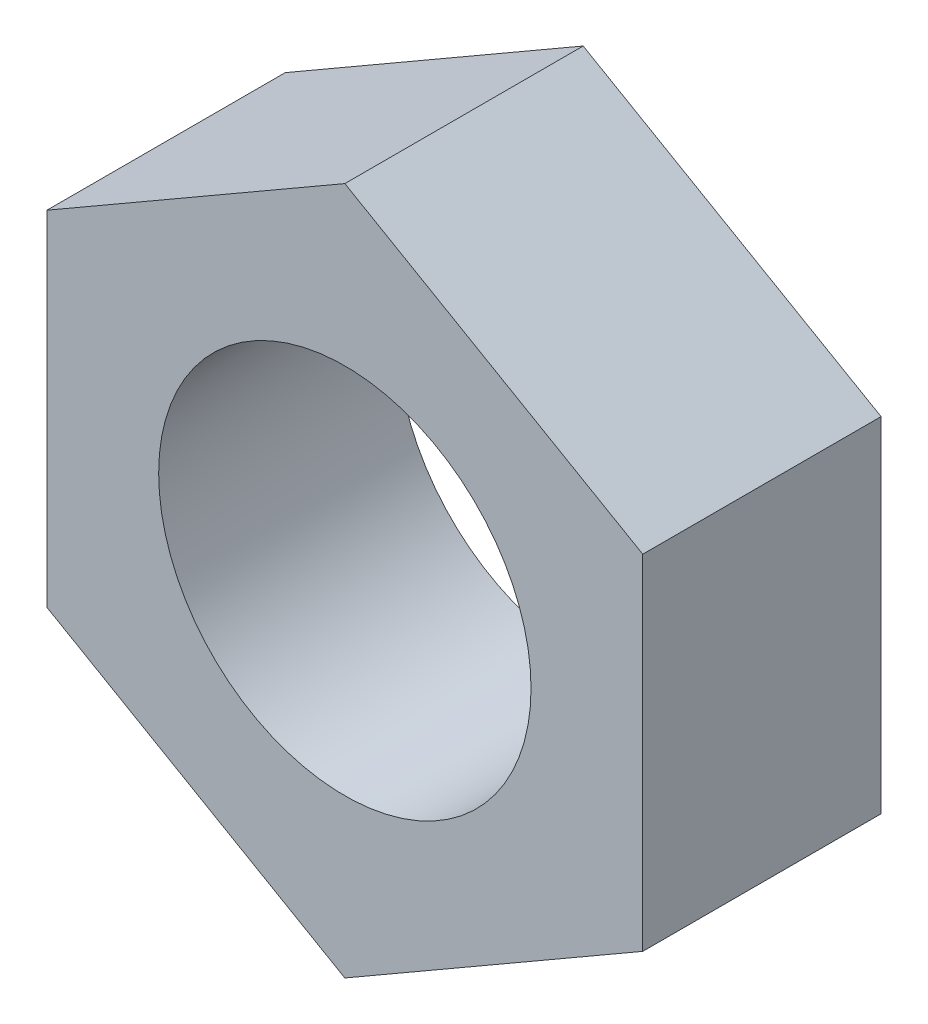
ISO-10303-21;
HEADER;
FILE_DESCRIPTION(('STEP AP214'),'2;1');
FILE_NAME('part.step','',(''),(''),'','','');
FILE_SCHEMA(('AUTOMOTIVE_DESIGN { 1 0 10303 214 1 1 1 1 }'));
ENDSEC;
DATA;
#1=APPLICATION_CONTEXT('core data for automotive mechanical design processes');
#2=APPLICATION_PROTOCOL_DEFINITION('international standard','automotive_design',2000,#1);
#3=PRODUCT_CONTEXT('',#1,'mechanical');
#4=PRODUCT('Part','Part','',(#3));
#5=PRODUCT_RELATED_PRODUCT_CATEGORY('part','',(#4));
#6=PRODUCT_DEFINITION_FORMATION('','',#4);
#7=PRODUCT_DEFINITION_CONTEXT('part definition',#1,'design');
#8=PRODUCT_DEFINITION('design','',#6,#7);
#9=PRODUCT_DEFINITION_SHAPE('','',#8);
#10=(LENGTH_UNIT() NAMED_UNIT(*) SI_UNIT(.MILLI.,.METRE.));
#11=(NAMED_UNIT(*) PLANE_ANGLE_UNIT() SI_UNIT($,.RADIAN.));
#12=(NAMED_UNIT(*) SI_UNIT($,.STERADIAN.) SOLID_ANGLE_UNIT());
#13=UNCERTAINTY_MEASURE_WITH_UNIT(LENGTH_MEASURE(1.E-05),#10,'distance_accuracy_value','');
#14=(GEOMETRIC_REPRESENTATION_CONTEXT(3) GLOBAL_UNCERTAINTY_ASSIGNED_CONTEXT((#13)) GLOBAL_UNIT_ASSIGNED_CONTEXT((#10,
#11,#12)) REPRESENTATION_CONTEXT('',''));
#15=CARTESIAN_POINT('',(0.,0.,0.));
#16=DIRECTION('',(0.,0.,1.));
#17=DIRECTION('',(1.,0.,0.));
#18=AXIS2_PLACEMENT_3D('',#15,#16,#17);
#19=CARTESIAN_POINT('',(4.,2.30940107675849,3.2));
#20=DIRECTION('',(-0.5,-0.866025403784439,0.));
#21=DIRECTION('',(0.86602540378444,-0.5,0.));
#22=AXIS2_PLACEMENT_3D('',#19,#20,#21);
#23=PLANE('',#22);
#24=DIRECTION('',(-0.866025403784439,0.5,0.));
#25=VECTOR('',#24,1.);
#26=CARTESIAN_POINT('',(4.,2.30940107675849,0.));
#27=LINE('',#26,#25);
#28=CARTESIAN_POINT('',(4.,2.30940107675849,0.));
#29=VERTEX_POINT('',#28);
#30=CARTESIAN_POINT('',(0.,4.61880215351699,0.));
#31=VERTEX_POINT('',#30);
#32=EDGE_CURVE('E71',#29,#31,#27,.T.);
#33=ORIENTED_EDGE('',*,*,#32,.T.);
#34=DIRECTION('',(0.,0.,-1.));
#35=VECTOR('',#34,1.);
#36=CARTESIAN_POINT('',(0.,4.61880215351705,3.19999999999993));
#37=LINE('',#36,#35);
#38=CARTESIAN_POINT('',(0.,4.61880215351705,3.19999999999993));
#39=VERTEX_POINT('',#38);
#40=EDGE_CURVE('E9',#39,#31,#37,.T.);
#41=ORIENTED_EDGE('',*,*,#40,.F.);
#42=DIRECTION('',(-0.866025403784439,0.5,0.));
#43=VECTOR('',#42,1.);
#44=CARTESIAN_POINT('',(4.,2.30940107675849,3.2));
#45=LINE('',#44,#43);
#46=CARTESIAN_POINT('',(4.,2.30940107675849,3.2));
#47=VERTEX_POINT('',#46);
#48=EDGE_CURVE('E97',#47,#39,#45,.T.);
#49=ORIENTED_EDGE('',*,*,#48,.F.);
#50=DIRECTION('',(0.,0.,-1.));
#51=VECTOR('',#50,1.);
#52=CARTESIAN_POINT('',(4.,2.30940107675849,3.2));
#53=LINE('',#52,#51);
#54=EDGE_CURVE('E84',#47,#29,#53,.T.);
#55=ORIENTED_EDGE('',*,*,#54,.T.);
#56=EDGE_LOOP('',(#33,#41,#49,#55));
#57=FACE_BOUND('',#56,.T.);
#58=ADVANCED_FACE('F14',(#57),#23,.F.);
#59=CARTESIAN_POINT('',(0.,4.61880215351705,3.19999999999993));
#60=DIRECTION('',(0.5,-0.86602540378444,0.));
#61=DIRECTION('',(0.866025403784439,0.5,0.));
#62=AXIS2_PLACEMENT_3D('',#59,#60,#61);
#63=PLANE('',#62);
#64=DIRECTION('',(-0.866025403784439,-0.5,0.));
#65=VECTOR('',#64,1.);
#66=CARTESIAN_POINT('',(0.,4.61880215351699,0.));
#67=LINE('',#66,#65);
#68=CARTESIAN_POINT('',(-4.,2.30940107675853,0.));
#69=VERTEX_POINT('',#68);
#70=EDGE_CURVE('E67',#31,#69,#67,.T.);
#71=ORIENTED_EDGE('',*,*,#70,.T.);
#72=DIRECTION('',(0.,0.,-1.));
#73=VECTOR('',#72,1.);
#74=CARTESIAN_POINT('',(-4.,2.30940107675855,3.19999999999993));
#75=LINE('',#74,#73);
#76=CARTESIAN_POINT('',(-4.,2.30940107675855,3.19999999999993));
#77=VERTEX_POINT('',#76);
#78=EDGE_CURVE('E22',#77,#69,#75,.T.);
#79=ORIENTED_EDGE('',*,*,#78,.F.);
#80=DIRECTION('',(-0.866025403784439,-0.5,0.));
#81=VECTOR('',#80,1.);
#82=CARTESIAN_POINT('',(0.,4.61880215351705,3.19999999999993));
#83=LINE('',#82,#81);
#84=EDGE_CURVE('E80',#39,#77,#83,.T.);
#85=ORIENTED_EDGE('',*,*,#84,.F.);
#86=ORIENTED_EDGE('',*,*,#40,.T.);
#87=EDGE_LOOP('',(#71,#79,#85,#86));
#88=FACE_BOUND('',#87,.T.);
#89=ADVANCED_FACE('F79',(#88),#63,.F.);
#90=CARTESIAN_POINT('',(-4.,2.30940107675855,3.19999999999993));
#91=DIRECTION('',(1.,0.,0.));
#92=DIRECTION('',(0.,1.,0.));
#93=AXIS2_PLACEMENT_3D('',#90,#91,#92);
#94=PLANE('',#93);
#95=DIRECTION('',(0.,-1.,0.));
#96=VECTOR('',#95,1.);
#97=CARTESIAN_POINT('',(-4.,2.30940107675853,0.));
#98=LINE('',#97,#96);
#99=CARTESIAN_POINT('',(-4.,-2.30940107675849,0.));
#100=VERTEX_POINT('',#99);
#101=EDGE_CURVE('E73',#69,#100,#98,.T.);
#102=ORIENTED_EDGE('',*,*,#101,.T.);
#103=DIRECTION('',(0.,0.,-1.));
#104=VECTOR('',#103,1.);
#105=CARTESIAN_POINT('',(-4.,-2.30940107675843,3.2));
#106=LINE('',#105,#104);
#107=CARTESIAN_POINT('',(-4.,-2.30940107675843,3.2));
#108=VERTEX_POINT('',#107);
#109=EDGE_CURVE('E113',#108,#100,#106,.T.);
#110=ORIENTED_EDGE('',*,*,#109,.F.);
#111=DIRECTION('',(0.,-1.,0.));
#112=VECTOR('',#111,1.);
#113=CARTESIAN_POINT('',(-4.,2.30940107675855,3.19999999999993));
#114=LINE('',#113,#112);
#115=EDGE_CURVE('E100',#77,#108,#114,.T.);
#116=ORIENTED_EDGE('',*,*,#115,.F.);
#117=ORIENTED_EDGE('',*,*,#78,.T.);
#118=EDGE_LOOP('',(#102,#110,#116,#117));
#119=FACE_BOUND('',#118,.T.);
#120=ADVANCED_FACE('F118',(#119),#94,.F.);
#121=CARTESIAN_POINT('',(-4.,-2.30940107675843,3.2));
#122=DIRECTION('',(0.5,0.866025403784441,0.));
#123=DIRECTION('',(-0.866025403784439,0.5,0.));
#124=AXIS2_PLACEMENT_3D('',#121,#122,#123);
#125=PLANE('',#124);
#126=DIRECTION('',(0.86602540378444,-0.5,0.));
#127=VECTOR('',#126,1.);
#128=CARTESIAN_POINT('',(-4.,-2.30940107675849,0.));
#129=LINE('',#128,#127);
#130=CARTESIAN_POINT('',(0.,-4.61880215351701,0.));
#131=VERTEX_POINT('',#130);
#132=EDGE_CURVE('E91',#100,#131,#129,.T.);
#133=ORIENTED_EDGE('',*,*,#132,.T.);
#134=DIRECTION('',(0.,0.,-1.));
#135=VECTOR('',#134,1.);
#136=CARTESIAN_POINT('',(0.,-4.61880215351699,3.2));
#137=LINE('',#136,#135);
#138=CARTESIAN_POINT('',(0.,-4.61880215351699,3.2));
#139=VERTEX_POINT('',#138);
#140=EDGE_CURVE('E110',#139,#131,#137,.T.);
#141=ORIENTED_EDGE('',*,*,#140,.F.);
#142=DIRECTION('',(0.86602540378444,-0.5,0.));
#143=VECTOR('',#142,1.);
#144=CARTESIAN_POINT('',(-4.,-2.30940107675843,3.2));
#145=LINE('',#144,#143);
#146=EDGE_CURVE('E102',#108,#139,#145,.T.);
#147=ORIENTED_EDGE('',*,*,#146,.F.);
#148=ORIENTED_EDGE('',*,*,#109,.T.);
#149=EDGE_LOOP('',(#133,#141,#147,#148));
#150=FACE_BOUND('',#149,.T.);
#151=ADVANCED_FACE('F124',(#150),#125,.F.);
#152=CARTESIAN_POINT('',(0.,-4.61880215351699,3.2));
#153=DIRECTION('',(-0.5,0.86602540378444,0.));
#154=DIRECTION('',(-0.866025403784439,-0.5,0.));
#155=AXIS2_PLACEMENT_3D('',#152,#153,#154);
#156=PLANE('',#155);
#157=DIRECTION('',(0.866025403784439,0.5,0.));
#158=VECTOR('',#157,1.);
#159=CARTESIAN_POINT('',(0.,-4.61880215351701,0.));
#160=LINE('',#159,#158);
#161=CARTESIAN_POINT('',(4.,-2.30940107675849,0.));
#162=VERTEX_POINT('',#161);
#163=EDGE_CURVE('E93',#131,#162,#160,.T.);
#164=ORIENTED_EDGE('',*,*,#163,.T.);
#165=DIRECTION('',(0.,0.,-1.));
#166=VECTOR('',#165,1.);
#167=CARTESIAN_POINT('',(4.,-2.30940107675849,3.2));
#168=LINE('',#167,#166);
#169=CARTESIAN_POINT('',(4.,-2.30940107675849,3.2));
#170=VERTEX_POINT('',#169);
#171=EDGE_CURVE('E107',#170,#162,#168,.T.);
#172=ORIENTED_EDGE('',*,*,#171,.F.);
#173=DIRECTION('',(0.866025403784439,0.5,0.));
#174=VECTOR('',#173,1.);
#175=CARTESIAN_POINT('',(0.,-4.61880215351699,3.2));
#176=LINE('',#175,#174);
#177=EDGE_CURVE('E34',#139,#170,#176,.T.);
#178=ORIENTED_EDGE('',*,*,#177,.F.);
#179=ORIENTED_EDGE('',*,*,#140,.T.);
#180=EDGE_LOOP('',(#164,#172,#178,#179));
#181=FACE_BOUND('',#180,.T.);
#182=ADVANCED_FACE('F127',(#181),#156,.F.);
#183=CARTESIAN_POINT('',(4.,-2.30940107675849,3.2));
#184=DIRECTION('',(-1.,0.,0.));
#185=DIRECTION('',(0.,-1.,0.));
#186=AXIS2_PLACEMENT_3D('',#183,#184,#185);
#187=PLANE('',#186);
#188=DIRECTION('',(0.,1.,0.));
#189=VECTOR('',#188,1.);
#190=CARTESIAN_POINT('',(4.,-2.30940107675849,0.));
#191=LINE('',#190,#189);
#192=EDGE_CURVE('E95',#162,#29,#191,.T.);
#193=ORIENTED_EDGE('',*,*,#192,.T.);
#194=ORIENTED_EDGE('',*,*,#54,.F.);
#195=DIRECTION('',(0.,1.,0.));
#196=VECTOR('',#195,1.);
#197=CARTESIAN_POINT('',(4.,-2.30940107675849,3.2));
#198=LINE('',#197,#196);
#199=EDGE_CURVE('E29',#170,#47,#198,.T.);
#200=ORIENTED_EDGE('',*,*,#199,.F.);
#201=ORIENTED_EDGE('',*,*,#171,.T.);
#202=EDGE_LOOP('',(#193,#194,#200,#201));
#203=FACE_BOUND('',#202,.T.);
#204=ADVANCED_FACE('F129',(#203),#187,.F.);
#205=CARTESIAN_POINT('',(4.,2.30940107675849,3.2));
#206=DIRECTION('',(0.,0.,-1.));
#207=DIRECTION('',(0.,1.,0.));
#208=AXIS2_PLACEMENT_3D('',#205,#206,#207);
#209=PLANE('',#208);
#210=CARTESIAN_POINT('',(0.,0.,3.2));
#211=DIRECTION('',(0.,0.,1.));
#212=DIRECTION('',(1.,0.,0.));
#213=AXIS2_PLACEMENT_3D('',#210,#211,#212);
#214=CIRCLE('',#213,2.5);
#215=CARTESIAN_POINT('',(2.5,0.,3.2));
#216=VERTEX_POINT('',#215);
#217=EDGE_CURVE('E87',#216,#216,#214,.T.);
#218=ORIENTED_EDGE('',*,*,#217,.F.);
#219=EDGE_LOOP('',(#218));
#220=FACE_BOUND('',#219,.T.);
#221=ORIENTED_EDGE('',*,*,#48,.T.);
#222=ORIENTED_EDGE('',*,*,#84,.T.);
#223=ORIENTED_EDGE('',*,*,#115,.T.);
#224=ORIENTED_EDGE('',*,*,#146,.T.);
#225=ORIENTED_EDGE('',*,*,#177,.T.);
#226=ORIENTED_EDGE('',*,*,#199,.T.);
#227=EDGE_LOOP('',(#221,#222,#223,#224,#225,#226));
#228=FACE_BOUND('',#227,.T.);
#229=ADVANCED_FACE('F121',(#220,#228),#209,.F.);
#230=CARTESIAN_POINT('',(4.,2.30940107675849,0.));
#231=DIRECTION('',(0.,0.,-1.));
#232=DIRECTION('',(0.,1.,0.));
#233=AXIS2_PLACEMENT_3D('',#230,#231,#232);
#234=PLANE('',#233);
#235=CARTESIAN_POINT('',(0.,0.,0.));
#236=DIRECTION('',(0.,0.,-1.));
#237=DIRECTION('',(0.,1.,0.));
#238=AXIS2_PLACEMENT_3D('',#235,#236,#237);
#239=CIRCLE('',#238,2.5);
#240=CARTESIAN_POINT('',(0.,2.50000000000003,0.));
#241=VERTEX_POINT('',#240);
#242=EDGE_CURVE('E17',#241,#241,#239,.T.);
#243=ORIENTED_EDGE('',*,*,#242,.F.);
#244=EDGE_LOOP('',(#243));
#245=FACE_BOUND('',#244,.T.);
#246=ORIENTED_EDGE('',*,*,#32,.F.);
#247=ORIENTED_EDGE('',*,*,#192,.F.);
#248=ORIENTED_EDGE('',*,*,#163,.F.);
#249=ORIENTED_EDGE('',*,*,#132,.F.);
#250=ORIENTED_EDGE('',*,*,#101,.F.);
#251=ORIENTED_EDGE('',*,*,#70,.F.);
#252=EDGE_LOOP('',(#246,#247,#248,#249,#250,#251));
#253=FACE_BOUND('',#252,.T.);
#254=ADVANCED_FACE('F68',(#245,#253),#234,.T.);
#255=CARTESIAN_POINT('',(0.,0.,-6.8));
#256=DIRECTION('',(0.,0.,1.));
#257=DIRECTION('',(1.,0.,0.));
#258=AXIS2_PLACEMENT_3D('',#255,#256,#257);
#259=CYLINDRICAL_SURFACE('',#258,2.5);
#260=ORIENTED_EDGE('',*,*,#242,.T.);
#261=EDGE_LOOP('',(#260));
#262=FACE_BOUND('',#261,.T.);
#263=ORIENTED_EDGE('',*,*,#217,.T.);
#264=EDGE_LOOP('',(#263));
#265=FACE_BOUND('',#264,.T.);
#266=ADVANCED_FACE('F185',(#262,#265),#259,.F.);
#267=CLOSED_SHELL('',(#58,#89,#120,#151,#182,#204,#229,#254,#266));
#268=MANIFOLD_SOLID_BREP('B1',#267);
#269=ADVANCED_BREP_SHAPE_REPRESENTATION('',(#18,#268),#14);
#270=SHAPE_DEFINITION_REPRESENTATION(#9,#269);
ENDSEC;
END-ISO-10303-21;
